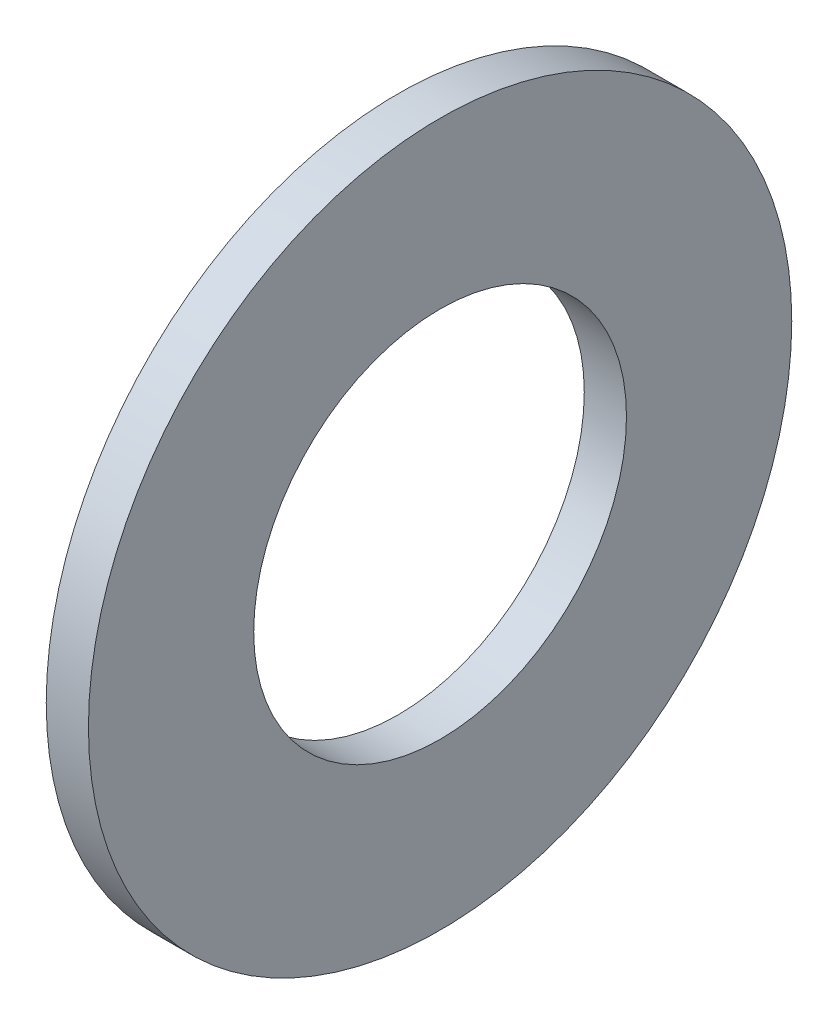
from build123d import *

# Parameters (mm, degrees)
ESQUISSE1_W = 0.6
ESQUISSE1_H = 2.35


with BuildPart() as part:
    # Esquisse1 → Base-R_volution (revolve)
    with BuildSketch(Plane(origin=(0, 0, 0), x_dir=(1, 0, 0), z_dir=(0, 1, 0)), mode=Mode.PRIVATE) as base_r_volution_sk:
        with Locations((0.3, 3.825)):
            Rectangle(ESQUISSE1_W, ESQUISSE1_H)
    revolve(base_r_volution_sk.sketch.rotate(Axis((0, 0, 0), (1, 0, 0)), 180), axis=Axis((0, 0, 0), (1, 0, 0)))


solid = part.part
